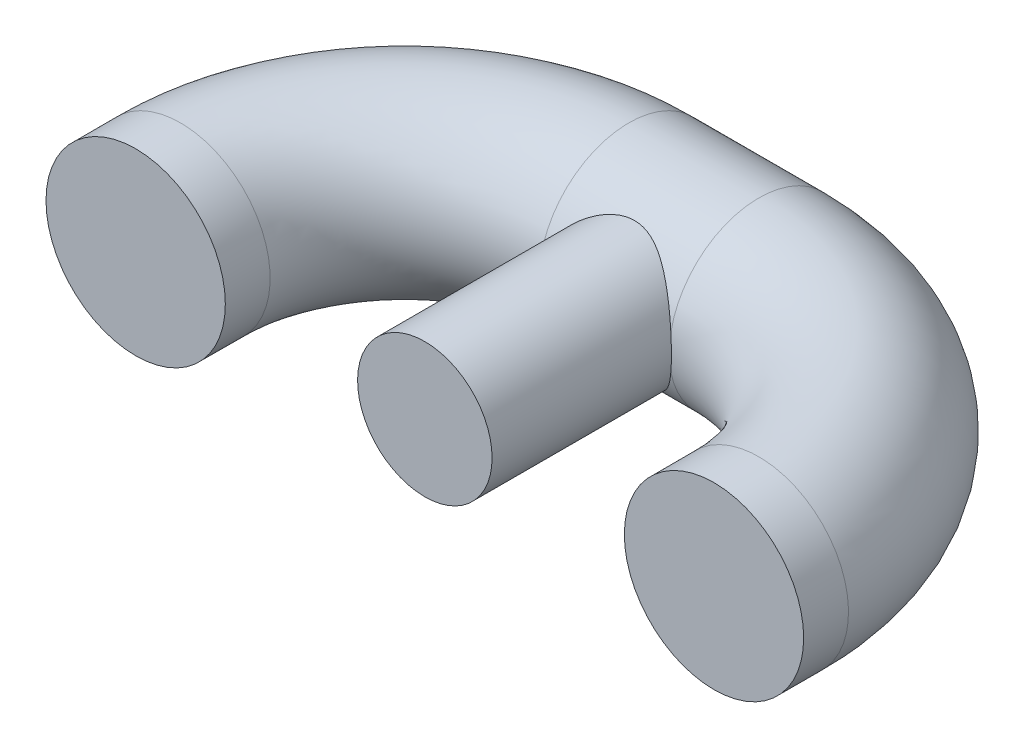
from build123d import *

# Parameters (mm, degrees)
SKETCH1_R             = 0.381
BOSS_EXTRUDE1_DEPTH   = 0.254
SKETCH1_R_2           = 0.508
BOSS_EXTRUDE1_2_DEPTH = 0.254
BOSS_EXTRUDE1_3_DEPTH = 0.254
SKETCH2_R             = 0.508
REVOLVE1_ANGLE        = 90
SKETCH3_R             = 0.508
REVOLVE2_ANGLE        = 90
BOSS_EXTRUDE2_REACH   = 5.121
SKETCH4_R             = 0.508
BOSS_EXTRUDE3_START   = 1.27
SKETCH5_R             = 0.381
BOSS_EXTRUDE3_DEPTH   = 1.27


with BuildPart() as part:
    # Sketch1 → Boss-Extrude1 (new body)
    with BuildSketch(Plane.XY):
        Circle(SKETCH1_R)
    extrude(amount=BOSS_EXTRUDE1_DEPTH)



with BuildPart() as body_2:
    # Sketch1 → Boss-Extrude1 2 (new body)
    with BuildSketch(Plane.XY):
        with Locations((1.6383, 0)):
            Circle(SKETCH1_R_2)
    extrude(amount=BOSS_EXTRUDE1_2_DEPTH)

    # Sketch2 → Revolve1 (revolve)
    with BuildSketch(Plane(origin=(0, 0, 0), x_dir=(-1, 0, 0), z_dir=(0, 0, -1))):
        with Locations(Location((-1.6383, 0, 0), (0, 0, 180))):
            Circle(SKETCH2_R)
    revolve(axis=Axis((0.3683, 1.878339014, 0), (0, 1, 0)), revolution_arc=REVOLVE1_ANGLE)


with BuildPart() as body_3:
    # Sketch1 → Boss-Extrude1 3 (new body)
    with BuildSketch(Plane.XY):
        with Locations((-1.6383, 0)):
            Circle(SKETCH1_R_2)
    extrude(amount=BOSS_EXTRUDE1_3_DEPTH)

    # Sketch3 → Revolve2 (revolve)
    with BuildSketch(Plane(origin=(0, 0, 0), x_dir=(-1, 0, 0), z_dir=(0, 0, -1))):
        with Locations((1.6383, 0)):
            Circle(SKETCH3_R)
    revolve(axis=Axis((-0.3683, 2.086823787, 0), (0, -1, 0)), revolution_arc=REVOLVE2_ANGLE)

    # Sketch4 → Boss-Extrude2 (add, up to next)
    with BuildSketch(Plane.ZY.offset(-0.3683), mode=Mode.PRIVATE) as boss_extrude2_sk1:
        with Locations(Location((-1.27, 0, 0), (0, 0, 179.99999999))):
            Circle(SKETCH4_R)
    boss_extrude2_tool1 = extrude(boss_extrude2_sk1.sketch, amount=BOSS_EXTRUDE2_REACH, mode=Mode.PRIVATE) - body_3.part

    add(body_2.part)  # Boss-Extrude2 merges body 2
    add(boss_extrude2_tool1.solids().sort_by_distance((0.3683, 0, -1.27))[0])


with BuildPart() as part_1:
    add(part.part)

    add(body_3.part)  # Boss-Extrude3 merges body 3
    # Sketch5 → Boss-Extrude3 (add)
    with BuildSketch(Plane(origin=(0, 0, 0), x_dir=(-1, 0, 0), z_dir=(0, 0, -1)).offset(BOSS_EXTRUDE3_START)):
        with Locations(Location((0, 0, 0), (0, 0, 14.835099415))):
            Circle(SKETCH5_R)
    extrude(amount=-BOSS_EXTRUDE3_DEPTH)


solid = part_1.part
